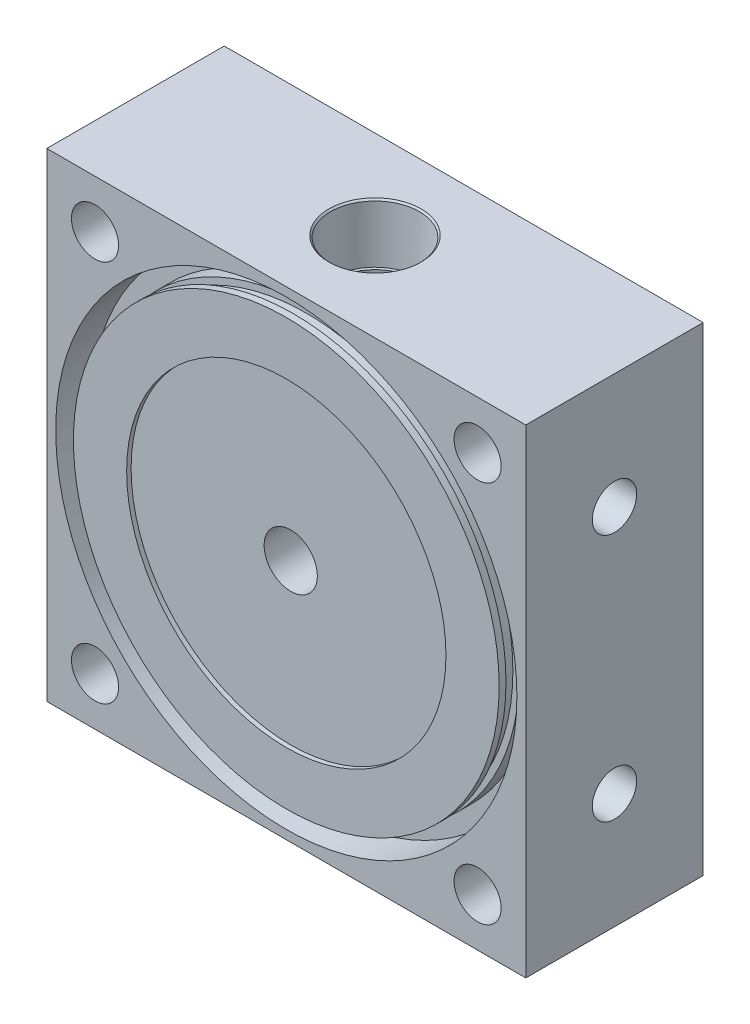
ISO-10303-21;
HEADER;
FILE_DESCRIPTION(('STEP AP214'),'2;1');
FILE_NAME('part.step','',(''),(''),'','','');
FILE_SCHEMA(('AUTOMOTIVE_DESIGN { 1 0 10303 214 1 1 1 1 }'));
ENDSEC;
DATA;
#1=APPLICATION_CONTEXT('core data for automotive mechanical design processes');
#2=APPLICATION_PROTOCOL_DEFINITION('international standard','automotive_design',2000,#1);
#3=PRODUCT_CONTEXT('',#1,'mechanical');
#4=PRODUCT('Part','Part','',(#3));
#5=PRODUCT_RELATED_PRODUCT_CATEGORY('part','',(#4));
#6=PRODUCT_DEFINITION_FORMATION('','',#4);
#7=PRODUCT_DEFINITION_CONTEXT('part definition',#1,'design');
#8=PRODUCT_DEFINITION('design','',#6,#7);
#9=PRODUCT_DEFINITION_SHAPE('','',#8);
#10=(LENGTH_UNIT() NAMED_UNIT(*) SI_UNIT(.MILLI.,.METRE.));
#11=(NAMED_UNIT(*) PLANE_ANGLE_UNIT() SI_UNIT($,.RADIAN.));
#12=(NAMED_UNIT(*) SI_UNIT($,.STERADIAN.) SOLID_ANGLE_UNIT());
#13=UNCERTAINTY_MEASURE_WITH_UNIT(LENGTH_MEASURE(1.E-05),#10,'distance_accuracy_value','');
#14=(GEOMETRIC_REPRESENTATION_CONTEXT(3) GLOBAL_UNCERTAINTY_ASSIGNED_CONTEXT((#13)) GLOBAL_UNIT_ASSIGNED_CONTEXT((#10,
#11,#12)) REPRESENTATION_CONTEXT('',''));
#15=CARTESIAN_POINT('',(0.,0.,0.));
#16=DIRECTION('',(0.,0.,1.));
#17=DIRECTION('',(1.,0.,0.));
#18=AXIS2_PLACEMENT_3D('',#15,#16,#17);
#19=CARTESIAN_POINT('',(-42.8625,-42.8625,31.75));
#20=DIRECTION('',(1.,0.,0.));
#21=DIRECTION('',(0.,0.,-1.));
#22=AXIS2_PLACEMENT_3D('',#19,#20,#21);
#23=PLANE('',#22);
#24=DIRECTION('',(0.,-1.,0.));
#25=VECTOR('',#24,1.);
#26=CARTESIAN_POINT('',(-42.8625,-42.8625,0.));
#27=LINE('',#26,#25);
#28=CARTESIAN_POINT('',(-42.8625,42.8625,0.));
#29=VERTEX_POINT('',#28);
#30=CARTESIAN_POINT('',(-42.8625,-42.8625,0.));
#31=VERTEX_POINT('',#30);
#32=EDGE_CURVE('E201',#29,#31,#27,.T.);
#33=ORIENTED_EDGE('',*,*,#32,.T.);
#34=DIRECTION('',(0.,0.,-1.));
#35=VECTOR('',#34,1.);
#36=CARTESIAN_POINT('',(-42.8625,-42.8625,31.75));
#37=LINE('',#36,#35);
#38=CARTESIAN_POINT('',(-42.8625,-42.8625,31.75));
#39=VERTEX_POINT('',#38);
#40=EDGE_CURVE('E11',#39,#31,#37,.T.);
#41=ORIENTED_EDGE('',*,*,#40,.F.);
#42=DIRECTION('',(0.,-1.,0.));
#43=VECTOR('',#42,1.);
#44=CARTESIAN_POINT('',(-42.8625,-42.8625,31.75));
#45=LINE('',#44,#43);
#46=CARTESIAN_POINT('',(-42.8625,42.8625,31.75));
#47=VERTEX_POINT('',#46);
#48=EDGE_CURVE('E204',#47,#39,#45,.T.);
#49=ORIENTED_EDGE('',*,*,#48,.F.);
#50=DIRECTION('',(0.,0.,-1.));
#51=VECTOR('',#50,1.);
#52=CARTESIAN_POINT('',(-42.8625,42.8625,31.75));
#53=LINE('',#52,#51);
#54=EDGE_CURVE('E210',#47,#29,#53,.T.);
#55=ORIENTED_EDGE('',*,*,#54,.T.);
#56=EDGE_LOOP('',(#33,#41,#49,#55));
#57=FACE_BOUND('',#56,.T.);
#58=ADVANCED_FACE('F34',(#57),#23,.F.);
#59=CARTESIAN_POINT('',(-42.8625,-42.8625,31.75));
#60=DIRECTION('',(0.,1.,0.));
#61=DIRECTION('',(0.,0.,1.));
#62=AXIS2_PLACEMENT_3D('',#59,#60,#61);
#63=PLANE('',#62);
#64=CARTESIAN_POINT('',(0.,-42.8625,15.875));
#65=DIRECTION('',(0.,-1.,0.));
#66=DIRECTION('',(0.,0.,-1.));
#67=AXIS2_PLACEMENT_3D('',#64,#65,#66);
#68=CIRCLE('',#67,3.175);
#69=CARTESIAN_POINT('',(0.,-42.8625,12.7));
#70=VERTEX_POINT('',#69);
#71=EDGE_CURVE('E115',#70,#70,#68,.T.);
#72=ORIENTED_EDGE('',*,*,#71,.F.);
#73=EDGE_LOOP('',(#72));
#74=FACE_BOUND('',#73,.T.);
#75=DIRECTION('',(1.,0.,0.));
#76=VECTOR('',#75,1.);
#77=CARTESIAN_POINT('',(-42.8625,-42.8625,0.));
#78=LINE('',#77,#76);
#79=CARTESIAN_POINT('',(42.8625,-42.8625,0.));
#80=VERTEX_POINT('',#79);
#81=EDGE_CURVE('E213',#31,#80,#78,.T.);
#82=ORIENTED_EDGE('',*,*,#81,.T.);
#83=DIRECTION('',(0.,0.,-1.));
#84=VECTOR('',#83,1.);
#85=CARTESIAN_POINT('',(42.8625,-42.8625,31.75));
#86=LINE('',#85,#84);
#87=CARTESIAN_POINT('',(42.8625,-42.8625,31.75));
#88=VERTEX_POINT('',#87);
#89=EDGE_CURVE('E47',#88,#80,#86,.T.);
#90=ORIENTED_EDGE('',*,*,#89,.F.);
#91=DIRECTION('',(1.,0.,0.));
#92=VECTOR('',#91,1.);
#93=CARTESIAN_POINT('',(-42.8625,-42.8625,31.75));
#94=LINE('',#93,#92);
#95=EDGE_CURVE('E87',#39,#88,#94,.T.);
#96=ORIENTED_EDGE('',*,*,#95,.F.);
#97=ORIENTED_EDGE('',*,*,#40,.T.);
#98=EDGE_LOOP('',(#82,#90,#96,#97));
#99=FACE_BOUND('',#98,.T.);
#100=ADVANCED_FACE('F244',(#74,#99),#63,.F.);
#101=CARTESIAN_POINT('',(42.8625,-42.8625,31.75));
#102=DIRECTION('',(-1.,0.,0.));
#103=DIRECTION('',(0.,-1.,0.));
#104=AXIS2_PLACEMENT_3D('',#101,#102,#103);
#105=PLANE('',#104);
#106=CARTESIAN_POINT('',(42.8625,22.225,15.875));
#107=DIRECTION('',(1.,0.,0.));
#108=DIRECTION('',(0.,0.,-1.));
#109=AXIS2_PLACEMENT_3D('',#106,#107,#108);
#110=CIRCLE('',#109,3.96875);
#111=CARTESIAN_POINT('',(42.8625,22.225,11.90625));
#112=VERTEX_POINT('',#111);
#113=EDGE_CURVE('E105',#112,#112,#110,.T.);
#114=ORIENTED_EDGE('',*,*,#113,.F.);
#115=EDGE_LOOP('',(#114));
#116=FACE_BOUND('',#115,.T.);
#117=CARTESIAN_POINT('',(42.8625,-22.225,15.875));
#118=DIRECTION('',(1.,0.,0.));
#119=DIRECTION('',(0.,0.,-1.));
#120=AXIS2_PLACEMENT_3D('',#117,#118,#119);
#121=CIRCLE('',#120,3.96875);
#122=CARTESIAN_POINT('',(42.8625,-22.225,11.90625));
#123=VERTEX_POINT('',#122);
#124=EDGE_CURVE('E104',#123,#123,#121,.T.);
#125=ORIENTED_EDGE('',*,*,#124,.F.);
#126=EDGE_LOOP('',(#125));
#127=FACE_BOUND('',#126,.T.);
#128=DIRECTION('',(0.,1.,0.));
#129=VECTOR('',#128,1.);
#130=CARTESIAN_POINT('',(42.8625,-42.8625,0.));
#131=LINE('',#130,#129);
#132=CARTESIAN_POINT('',(42.8625,42.8625,0.));
#133=VERTEX_POINT('',#132);
#134=EDGE_CURVE('E74',#80,#133,#131,.T.);
#135=ORIENTED_EDGE('',*,*,#134,.T.);
#136=DIRECTION('',(0.,0.,-1.));
#137=VECTOR('',#136,1.);
#138=CARTESIAN_POINT('',(42.8625,42.8625,31.75));
#139=LINE('',#138,#137);
#140=CARTESIAN_POINT('',(42.8625,42.8625,31.75));
#141=VERTEX_POINT('',#140);
#142=EDGE_CURVE('E218',#141,#133,#139,.T.);
#143=ORIENTED_EDGE('',*,*,#142,.F.);
#144=DIRECTION('',(0.,1.,0.));
#145=VECTOR('',#144,1.);
#146=CARTESIAN_POINT('',(42.8625,-42.8625,31.75));
#147=LINE('',#146,#145);
#148=EDGE_CURVE('E207',#88,#141,#147,.T.);
#149=ORIENTED_EDGE('',*,*,#148,.F.);
#150=ORIENTED_EDGE('',*,*,#89,.T.);
#151=EDGE_LOOP('',(#135,#143,#149,#150));
#152=FACE_BOUND('',#151,.T.);
#153=ADVANCED_FACE('F249',(#116,#127,#152),#105,.F.);
#154=CARTESIAN_POINT('',(-42.8625,42.8625,31.75));
#155=DIRECTION('',(0.,-1.,0.));
#156=DIRECTION('',(0.,0.,-1.));
#157=AXIS2_PLACEMENT_3D('',#154,#155,#156);
#158=PLANE('',#157);
#159=CARTESIAN_POINT('',(0.,42.8625,15.875));
#160=DIRECTION('',(0.,1.,0.));
#161=DIRECTION('',(0.,0.,1.));
#162=AXIS2_PLACEMENT_3D('',#159,#160,#161);
#163=CIRCLE('',#162,8.255);
#164=CARTESIAN_POINT('',(0.,42.8625,24.13));
#165=VERTEX_POINT('',#164);
#166=EDGE_CURVE('E152',#165,#165,#163,.T.);
#167=ORIENTED_EDGE('',*,*,#166,.F.);
#168=EDGE_LOOP('',(#167));
#169=FACE_BOUND('',#168,.T.);
#170=DIRECTION('',(-1.,0.,0.));
#171=VECTOR('',#170,1.);
#172=CARTESIAN_POINT('',(-42.8625,42.8625,0.));
#173=LINE('',#172,#171);
#174=EDGE_CURVE('E80',#133,#29,#173,.T.);
#175=ORIENTED_EDGE('',*,*,#174,.T.);
#176=ORIENTED_EDGE('',*,*,#54,.F.);
#177=DIRECTION('',(-1.,0.,0.));
#178=VECTOR('',#177,1.);
#179=CARTESIAN_POINT('',(-42.8625,42.8625,31.75));
#180=LINE('',#179,#178);
#181=EDGE_CURVE('E56',#141,#47,#180,.T.);
#182=ORIENTED_EDGE('',*,*,#181,.F.);
#183=ORIENTED_EDGE('',*,*,#142,.T.);
#184=EDGE_LOOP('',(#175,#176,#182,#183));
#185=FACE_BOUND('',#184,.T.);
#186=ADVANCED_FACE('F259',(#169,#185),#158,.F.);
#187=CARTESIAN_POINT('',(-42.8625,42.8625,31.75));
#188=DIRECTION('',(0.,0.,-1.));
#189=DIRECTION('',(-1.,0.,0.));
#190=AXIS2_PLACEMENT_3D('',#187,#188,#189);
#191=PLANE('',#190);
#192=CARTESIAN_POINT('',(-34.2372264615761,34.2372264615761,31.75));
#193=DIRECTION('',(0.,0.,1.));
#194=DIRECTION('',(1.,0.,0.));
#195=AXIS2_PLACEMENT_3D('',#192,#193,#194);
#196=CIRCLE('',#195,4.21639999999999);
#197=CARTESIAN_POINT('',(-30.0208264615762,34.2372264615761,31.75));
#198=VERTEX_POINT('',#197);
#199=EDGE_CURVE('E167',#198,#198,#196,.T.);
#200=ORIENTED_EDGE('',*,*,#199,.F.);
#201=EDGE_LOOP('',(#200));
#202=FACE_BOUND('',#201,.T.);
#203=CARTESIAN_POINT('',(34.2372264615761,34.2372264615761,31.75));
#204=DIRECTION('',(0.,0.,1.));
#205=DIRECTION('',(1.,0.,0.));
#206=AXIS2_PLACEMENT_3D('',#203,#204,#205);
#207=CIRCLE('',#206,4.21639999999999);
#208=CARTESIAN_POINT('',(38.4536264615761,34.2372264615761,31.75));
#209=VERTEX_POINT('',#208);
#210=EDGE_CURVE('E173',#209,#209,#207,.T.);
#211=ORIENTED_EDGE('',*,*,#210,.F.);
#212=EDGE_LOOP('',(#211));
#213=FACE_BOUND('',#212,.T.);
#214=CARTESIAN_POINT('',(34.2372264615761,-34.2372264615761,31.75));
#215=DIRECTION('',(0.,0.,1.));
#216=DIRECTION('',(1.,0.,0.));
#217=AXIS2_PLACEMENT_3D('',#214,#215,#216);
#218=CIRCLE('',#217,4.21639999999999);
#219=CARTESIAN_POINT('',(38.4536264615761,-34.2372264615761,31.75));
#220=VERTEX_POINT('',#219);
#221=EDGE_CURVE('E179',#220,#220,#218,.T.);
#222=ORIENTED_EDGE('',*,*,#221,.F.);
#223=EDGE_LOOP('',(#222));
#224=FACE_BOUND('',#223,.T.);
#225=CARTESIAN_POINT('',(-34.2372264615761,-34.2372264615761,31.75));
#226=DIRECTION('',(0.,0.,1.));
#227=DIRECTION('',(1.,0.,0.));
#228=AXIS2_PLACEMENT_3D('',#225,#226,#227);
#229=CIRCLE('',#228,4.21639999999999);
#230=CARTESIAN_POINT('',(-30.0208264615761,-34.2372264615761,31.75));
#231=VERTEX_POINT('',#230);
#232=EDGE_CURVE('E185',#231,#231,#229,.T.);
#233=ORIENTED_EDGE('',*,*,#232,.F.);
#234=EDGE_LOOP('',(#233));
#235=FACE_BOUND('',#234,.T.);
#236=CARTESIAN_POINT('',(0.,0.,31.75));
#237=DIRECTION('',(0.,0.,1.));
#238=DIRECTION('',(1.,0.,0.));
#239=AXIS2_PLACEMENT_3D('',#236,#237,#238);
#240=CIRCLE('',#239,41.275);
#241=CARTESIAN_POINT('',(41.275,0.,31.75));
#242=VERTEX_POINT('',#241);
#243=EDGE_CURVE('E195',#242,#242,#240,.T.);
#244=ORIENTED_EDGE('',*,*,#243,.F.);
#245=EDGE_LOOP('',(#244));
#246=FACE_BOUND('',#245,.T.);
#247=ORIENTED_EDGE('',*,*,#48,.T.);
#248=ORIENTED_EDGE('',*,*,#95,.T.);
#249=ORIENTED_EDGE('',*,*,#148,.T.);
#250=ORIENTED_EDGE('',*,*,#181,.T.);
#251=EDGE_LOOP('',(#247,#248,#249,#250));
#252=FACE_BOUND('',#251,.T.);
#253=ADVANCED_FACE('F257',(#202,#213,#224,#235,#246,#252),#191,.F.);
#254=CARTESIAN_POINT('',(-42.8625,42.8625,0.));
#255=DIRECTION('',(0.,0.,-1.));
#256=DIRECTION('',(-1.,0.,0.));
#257=AXIS2_PLACEMENT_3D('',#254,#255,#256);
#258=PLANE('',#257);
#259=CARTESIAN_POINT('',(-34.2372264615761,34.2372264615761,0.));
#260=DIRECTION('',(0.,0.,1.));
#261=DIRECTION('',(1.,0.,0.));
#262=AXIS2_PLACEMENT_3D('',#259,#260,#261);
#263=CIRCLE('',#262,4.21639999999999);
#264=CARTESIAN_POINT('',(-30.0208264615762,34.2372264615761,0.));
#265=VERTEX_POINT('',#264);
#266=EDGE_CURVE('E170',#265,#265,#263,.T.);
#267=ORIENTED_EDGE('',*,*,#266,.T.);
#268=EDGE_LOOP('',(#267));
#269=FACE_BOUND('',#268,.T.);
#270=CARTESIAN_POINT('',(34.2372264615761,34.2372264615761,0.));
#271=DIRECTION('',(0.,0.,1.));
#272=DIRECTION('',(1.,0.,0.));
#273=AXIS2_PLACEMENT_3D('',#270,#271,#272);
#274=CIRCLE('',#273,4.21639999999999);
#275=CARTESIAN_POINT('',(38.4536264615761,34.2372264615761,0.));
#276=VERTEX_POINT('',#275);
#277=EDGE_CURVE('E176',#276,#276,#274,.T.);
#278=ORIENTED_EDGE('',*,*,#277,.T.);
#279=EDGE_LOOP('',(#278));
#280=FACE_BOUND('',#279,.T.);
#281=CARTESIAN_POINT('',(34.2372264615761,-34.2372264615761,0.));
#282=DIRECTION('',(0.,0.,1.));
#283=DIRECTION('',(1.,0.,0.));
#284=AXIS2_PLACEMENT_3D('',#281,#282,#283);
#285=CIRCLE('',#284,4.21639999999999);
#286=CARTESIAN_POINT('',(38.4536264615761,-34.2372264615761,0.));
#287=VERTEX_POINT('',#286);
#288=EDGE_CURVE('E182',#287,#287,#285,.T.);
#289=ORIENTED_EDGE('',*,*,#288,.T.);
#290=EDGE_LOOP('',(#289));
#291=FACE_BOUND('',#290,.T.);
#292=CARTESIAN_POINT('',(-34.2372264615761,-34.2372264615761,0.));
#293=DIRECTION('',(0.,0.,1.));
#294=DIRECTION('',(1.,0.,0.));
#295=AXIS2_PLACEMENT_3D('',#292,#293,#294);
#296=CIRCLE('',#295,4.21639999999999);
#297=CARTESIAN_POINT('',(-30.0208264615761,-34.2372264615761,0.));
#298=VERTEX_POINT('',#297);
#299=EDGE_CURVE('E188',#298,#298,#296,.T.);
#300=ORIENTED_EDGE('',*,*,#299,.T.);
#301=EDGE_LOOP('',(#300));
#302=FACE_BOUND('',#301,.T.);
#303=ORIENTED_EDGE('',*,*,#32,.F.);
#304=ORIENTED_EDGE('',*,*,#174,.F.);
#305=ORIENTED_EDGE('',*,*,#134,.F.);
#306=ORIENTED_EDGE('',*,*,#81,.F.);
#307=EDGE_LOOP('',(#303,#304,#305,#306));
#308=FACE_BOUND('',#307,.T.);
#309=ADVANCED_FACE('F255',(#269,#280,#291,#302,#308),#258,.T.);
#310=CARTESIAN_POINT('',(0.,0.,25.4));
#311=DIRECTION('',(0.,0.,1.));
#312=DIRECTION('',(1.,0.,0.));
#313=AXIS2_PLACEMENT_3D('',#310,#311,#312);
#314=CYLINDRICAL_SURFACE('',#313,41.275);
#315=CARTESIAN_POINT('',(0.,0.,25.4));
#316=DIRECTION('',(0.,0.,1.));
#317=DIRECTION('',(1.,0.,0.));
#318=AXIS2_PLACEMENT_3D('',#315,#316,#317);
#319=CIRCLE('',#318,41.275);
#320=CARTESIAN_POINT('',(41.275,0.,25.4));
#321=VERTEX_POINT('',#320);
#322=EDGE_CURVE('E198',#321,#321,#319,.T.);
#323=ORIENTED_EDGE('',*,*,#322,.F.);
#324=EDGE_LOOP('',(#323));
#325=FACE_BOUND('',#324,.T.);
#326=ORIENTED_EDGE('',*,*,#243,.T.);
#327=EDGE_LOOP('',(#326));
#328=FACE_BOUND('',#327,.T.);
#329=ADVANCED_FACE('F267',(#325,#328),#314,.F.);
#330=CARTESIAN_POINT('',(0.,0.,25.4));
#331=DIRECTION('',(0.,0.,1.));
#332=DIRECTION('',(1.,0.,0.));
#333=AXIS2_PLACEMENT_3D('',#330,#331,#332);
#334=PLANE('',#333);
#335=CARTESIAN_POINT('',(0.,0.,25.4));
#336=DIRECTION('',(0.,0.,1.));
#337=DIRECTION('',(1.,0.,0.));
#338=AXIS2_PLACEMENT_3D('',#335,#336,#337);
#339=CIRCLE('',#338,38.1);
#340=CARTESIAN_POINT('',(38.1,0.,25.4));
#341=VERTEX_POINT('',#340);
#342=EDGE_CURVE('E192',#341,#341,#339,.T.);
#343=ORIENTED_EDGE('',*,*,#342,.F.);
#344=EDGE_LOOP('',(#343));
#345=FACE_BOUND('',#344,.T.);
#346=ORIENTED_EDGE('',*,*,#322,.T.);
#347=EDGE_LOOP('',(#346));
#348=FACE_BOUND('',#347,.T.);
#349=ADVANCED_FACE('F429',(#345,#348),#334,.T.);
#350=CARTESIAN_POINT('',(0.,0.,25.4));
#351=DIRECTION('',(0.,0.,1.));
#352=DIRECTION('',(1.,0.,0.));
#353=AXIS2_PLACEMENT_3D('',#350,#351,#352);
#354=CYLINDRICAL_SURFACE('',#353,38.1);
#355=CARTESIAN_POINT('',(0.,0.,28.14955));
#356=DIRECTION('',(0.,0.,-1.));
#357=DIRECTION('',(-1.,0.,0.));
#358=AXIS2_PLACEMENT_3D('',#355,#356,#357);
#359=CIRCLE('',#358,38.1);
#360=CARTESIAN_POINT('',(-38.1,0.,28.14955));
#361=VERTEX_POINT('',#360);
#362=EDGE_CURVE('E133',#361,#361,#359,.T.);
#363=ORIENTED_EDGE('',*,*,#362,.T.);
#364=EDGE_LOOP('',(#363));
#365=FACE_BOUND('',#364,.T.);
#366=ORIENTED_EDGE('',*,*,#342,.T.);
#367=EDGE_LOOP('',(#366));
#368=FACE_BOUND('',#367,.T.);
#369=ADVANCED_FACE('F285',(#365,#368),#354,.T.);
#370=CARTESIAN_POINT('',(-34.2372264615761,-34.2372264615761,31.75));
#371=DIRECTION('',(0.,0.,1.));
#372=DIRECTION('',(1.,0.,0.));
#373=AXIS2_PLACEMENT_3D('',#370,#371,#372);
#374=CYLINDRICAL_SURFACE('',#373,4.21639999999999);
#375=ORIENTED_EDGE('',*,*,#299,.F.);
#376=EDGE_LOOP('',(#375));
#377=FACE_BOUND('',#376,.T.);
#378=ORIENTED_EDGE('',*,*,#232,.T.);
#379=EDGE_LOOP('',(#378));
#380=FACE_BOUND('',#379,.T.);
#381=ADVANCED_FACE('F428',(#377,#380),#374,.F.);
#382=CARTESIAN_POINT('',(34.2372264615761,-34.2372264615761,31.75));
#383=DIRECTION('',(0.,0.,1.));
#384=DIRECTION('',(1.,0.,0.));
#385=AXIS2_PLACEMENT_3D('',#382,#383,#384);
#386=CYLINDRICAL_SURFACE('',#385,4.21639999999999);
#387=ORIENTED_EDGE('',*,*,#288,.F.);
#388=EDGE_LOOP('',(#387));
#389=FACE_BOUND('',#388,.T.);
#390=ORIENTED_EDGE('',*,*,#221,.T.);
#391=EDGE_LOOP('',(#390));
#392=FACE_BOUND('',#391,.T.);
#393=ADVANCED_FACE('F537',(#389,#392),#386,.F.);
#394=CARTESIAN_POINT('',(34.2372264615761,34.2372264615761,31.75));
#395=DIRECTION('',(0.,0.,1.));
#396=DIRECTION('',(1.,0.,0.));
#397=AXIS2_PLACEMENT_3D('',#394,#395,#396);
#398=CYLINDRICAL_SURFACE('',#397,4.21639999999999);
#399=ORIENTED_EDGE('',*,*,#277,.F.);
#400=EDGE_LOOP('',(#399));
#401=FACE_BOUND('',#400,.T.);
#402=ORIENTED_EDGE('',*,*,#210,.T.);
#403=EDGE_LOOP('',(#402));
#404=FACE_BOUND('',#403,.T.);
#405=ADVANCED_FACE('F532',(#401,#404),#398,.F.);
#406=CARTESIAN_POINT('',(-34.2372264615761,34.2372264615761,31.75));
#407=DIRECTION('',(0.,0.,1.));
#408=DIRECTION('',(1.,0.,0.));
#409=AXIS2_PLACEMENT_3D('',#406,#407,#408);
#410=CYLINDRICAL_SURFACE('',#409,4.21639999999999);
#411=ORIENTED_EDGE('',*,*,#266,.F.);
#412=EDGE_LOOP('',(#411));
#413=FACE_BOUND('',#412,.T.);
#414=ORIENTED_EDGE('',*,*,#199,.T.);
#415=EDGE_LOOP('',(#414));
#416=FACE_BOUND('',#415,.T.);
#417=ADVANCED_FACE('F358',(#413,#416),#410,.F.);
#418=CARTESIAN_POINT('',(0.,25.4635,15.875));
#419=DIRECTION('',(0.,1.,0.));
#420=DIRECTION('',(0.,0.,1.));
#421=AXIS2_PLACEMENT_3D('',#418,#419,#420);
#422=CONICAL_SURFACE('',#421,7.1374,1.02974425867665);
#423=CARTESIAN_POINT('',(0.,24.2749521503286,15.875));
#424=DIRECTION('',(0.,1.,0.));
#425=DIRECTION('',(0.,0.,1.));
#426=AXIS2_PLACEMENT_3D('',#423,#424,#425);
#427=CIRCLE('',#426,5.1593242);
#428=CARTESIAN_POINT('',(0.,24.2749521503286,21.0343242));
#429=VERTEX_POINT('',#428);
#430=EDGE_CURVE('E130',#429,#429,#427,.F.);
#431=ORIENTED_EDGE('',*,*,#430,.T.);
#432=EDGE_LOOP('',(#431));
#433=FACE_BOUND('',#432,.T.);
#434=CARTESIAN_POINT('',(0.,25.4635,15.875));
#435=DIRECTION('',(0.,1.,0.));
#436=DIRECTION('',(0.,0.,1.));
#437=AXIS2_PLACEMENT_3D('',#434,#435,#436);
#438=CIRCLE('',#437,7.1374);
#439=CARTESIAN_POINT('',(0.,25.4635,23.0124));
#440=VERTEX_POINT('',#439);
#441=EDGE_CURVE('E164',#440,#440,#438,.T.);
#442=ORIENTED_EDGE('',*,*,#441,.T.);
#443=EDGE_LOOP('',(#442));
#444=FACE_BOUND('',#443,.T.);
#445=ADVANCED_FACE('F369',(#433,#444),#422,.F.);
#446=CARTESIAN_POINT('',(0.,42.8625,15.875));
#447=DIRECTION('',(0.,1.,0.));
#448=DIRECTION('',(0.,0.,1.));
#449=AXIS2_PLACEMENT_3D('',#446,#447,#448);
#450=CYLINDRICAL_SURFACE('',#449,7.1374);
#451=ORIENTED_EDGE('',*,*,#441,.F.);
#452=EDGE_LOOP('',(#451));
#453=FACE_BOUND('',#452,.T.);
#454=CARTESIAN_POINT('',(0.,32.5247,15.875));
#455=DIRECTION('',(0.,1.,0.));
#456=DIRECTION('',(0.,0.,1.));
#457=AXIS2_PLACEMENT_3D('',#454,#455,#456);
#458=CIRCLE('',#457,7.1374);
#459=CARTESIAN_POINT('',(0.,32.5247,23.0124));
#460=VERTEX_POINT('',#459);
#461=EDGE_CURVE('E161',#460,#460,#458,.T.);
#462=ORIENTED_EDGE('',*,*,#461,.T.);
#463=EDGE_LOOP('',(#462));
#464=FACE_BOUND('',#463,.T.);
#465=ADVANCED_FACE('F363',(#453,#464),#450,.F.);
#466=CARTESIAN_POINT('',(7.1374,32.5247,15.875));
#467=DIRECTION('',(0.,-1.,0.));
#468=DIRECTION('',(0.,0.,-1.));
#469=AXIS2_PLACEMENT_3D('',#466,#467,#468);
#470=PLANE('',#469);
#471=ORIENTED_EDGE('',*,*,#461,.F.);
#472=EDGE_LOOP('',(#471));
#473=FACE_BOUND('',#472,.T.);
#474=CARTESIAN_POINT('',(0.,32.5247,15.875));
#475=DIRECTION('',(0.,1.,0.));
#476=DIRECTION('',(0.,0.,1.));
#477=AXIS2_PLACEMENT_3D('',#474,#475,#476);
#478=CIRCLE('',#477,7.66468079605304);
#479=CARTESIAN_POINT('',(0.,32.5247,23.539680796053));
#480=VERTEX_POINT('',#479);
#481=EDGE_CURVE('E158',#480,#480,#478,.T.);
#482=ORIENTED_EDGE('',*,*,#481,.T.);
#483=EDGE_LOOP('',(#482));
#484=FACE_BOUND('',#483,.T.);
#485=ADVANCED_FACE('F368',(#473,#484),#470,.F.);
#486=CARTESIAN_POINT('',(0.,42.5730416,15.875));
#487=DIRECTION('',(0.,1.,0.));
#488=DIRECTION('',(0.,0.,1.));
#489=AXIS2_PLACEMENT_3D('',#486,#487,#488);
#490=CONICAL_SURFACE('',#489,7.9655416,0.029932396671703);
#491=ORIENTED_EDGE('',*,*,#481,.F.);
#492=EDGE_LOOP('',(#491));
#493=FACE_BOUND('',#492,.T.);
#494=CARTESIAN_POINT('',(0.,42.5730416,15.875));
#495=DIRECTION('',(0.,1.,0.));
#496=DIRECTION('',(0.,0.,1.));
#497=AXIS2_PLACEMENT_3D('',#494,#495,#496);
#498=CIRCLE('',#497,7.9655416);
#499=CARTESIAN_POINT('',(0.,42.5730416,23.8405416));
#500=VERTEX_POINT('',#499);
#501=EDGE_CURVE('E155',#500,#500,#498,.T.);
#502=ORIENTED_EDGE('',*,*,#501,.T.);
#503=EDGE_LOOP('',(#502));
#504=FACE_BOUND('',#503,.T.);
#505=ADVANCED_FACE('F381',(#493,#504),#490,.F.);
#506=CARTESIAN_POINT('',(0.,42.8625,15.875));
#507=DIRECTION('',(0.,1.,0.));
#508=DIRECTION('',(0.,0.,1.));
#509=AXIS2_PLACEMENT_3D('',#506,#507,#508);
#510=CONICAL_SURFACE('',#509,8.255,0.785398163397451);
#511=ORIENTED_EDGE('',*,*,#501,.F.);
#512=EDGE_LOOP('',(#511));
#513=FACE_BOUND('',#512,.T.);
#514=ORIENTED_EDGE('',*,*,#166,.T.);
#515=EDGE_LOOP('',(#514));
#516=FACE_BOUND('',#515,.T.);
#517=ADVANCED_FACE('F299',(#513,#516),#510,.F.);
#518=CARTESIAN_POINT('',(0.,38.1,30.5308));
#519=DIRECTION('',(0.,0.,1.));
#520=DIRECTION('',(1.,0.,0.));
#521=AXIS2_PLACEMENT_3D('',#518,#519,#520);
#522=PLANE('',#521);
#523=CARTESIAN_POINT('',(0.,0.,30.5308));
#524=DIRECTION('',(0.,0.,-1.));
#525=DIRECTION('',(-1.,0.,0.));
#526=AXIS2_PLACEMENT_3D('',#523,#524,#525);
#527=CIRCLE('',#526,36.957);
#528=CARTESIAN_POINT('',(-36.957,0.,30.5308));
#529=VERTEX_POINT('',#528);
#530=EDGE_CURVE('E139',#529,#529,#527,.T.);
#531=ORIENTED_EDGE('',*,*,#530,.F.);
#532=EDGE_LOOP('',(#531));
#533=FACE_BOUND('',#532,.T.);
#534=CARTESIAN_POINT('',(0.,0.,30.5308));
#535=DIRECTION('',(0.,0.,-1.));
#536=DIRECTION('',(-1.,0.,0.));
#537=AXIS2_PLACEMENT_3D('',#534,#535,#536);
#538=CIRCLE('',#537,38.1);
#539=CARTESIAN_POINT('',(-38.1,0.,30.5308));
#540=VERTEX_POINT('',#539);
#541=EDGE_CURVE('E142',#540,#540,#538,.T.);
#542=ORIENTED_EDGE('',*,*,#541,.T.);
#543=EDGE_LOOP('',(#542));
#544=FACE_BOUND('',#543,.T.);
#545=ADVANCED_FACE('F296',(#533,#544),#522,.F.);
#546=CARTESIAN_POINT('',(0.,0.,0.));
#547=DIRECTION('',(0.,0.,-1.));
#548=DIRECTION('',(-1.,0.,0.));
#549=AXIS2_PLACEMENT_3D('',#546,#547,#548);
#550=CYLINDRICAL_SURFACE('',#549,36.957);
#551=CARTESIAN_POINT('',(0.,0.,28.14955));
#552=DIRECTION('',(0.,0.,-1.));
#553=DIRECTION('',(-1.,0.,0.));
#554=AXIS2_PLACEMENT_3D('',#551,#552,#553);
#555=CIRCLE('',#554,36.957);
#556=CARTESIAN_POINT('',(-36.957,0.,28.14955));
#557=VERTEX_POINT('',#556);
#558=EDGE_CURVE('E136',#557,#557,#555,.T.);
#559=ORIENTED_EDGE('',*,*,#558,.F.);
#560=EDGE_LOOP('',(#559));
#561=FACE_BOUND('',#560,.T.);
#562=ORIENTED_EDGE('',*,*,#530,.T.);
#563=EDGE_LOOP('',(#562));
#564=FACE_BOUND('',#563,.T.);
#565=ADVANCED_FACE('F236',(#561,#564),#550,.T.);
#566=CARTESIAN_POINT('',(0.,36.957,28.14955));
#567=DIRECTION('',(0.,0.,-1.));
#568=DIRECTION('',(-1.,0.,0.));
#569=AXIS2_PLACEMENT_3D('',#566,#567,#568);
#570=PLANE('',#569);
#571=ORIENTED_EDGE('',*,*,#362,.F.);
#572=EDGE_LOOP('',(#571));
#573=FACE_BOUND('',#572,.T.);
#574=ORIENTED_EDGE('',*,*,#558,.T.);
#575=EDGE_LOOP('',(#574));
#576=FACE_BOUND('',#575,.T.);
#577=ADVANCED_FACE('F227',(#573,#576),#570,.F.);
#578=CARTESIAN_POINT('',(0.,0.,31.75));
#579=DIRECTION('',(0.,0.,1.));
#580=DIRECTION('',(1.,0.,0.));
#581=AXIS2_PLACEMENT_3D('',#578,#579,#580);
#582=CYLINDRICAL_SURFACE('',#581,4.7625);
#583=CARTESIAN_POINT('',(4.7625,0.,17.8592429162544));
#584=CARTESIAN_POINT('',(4.76249932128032,-0.0659606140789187,17.8592455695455));
#585=CARTESIAN_POINT('',(4.76112335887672,-0.131941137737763,17.8625573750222));
#586=CARTESIAN_POINT('',(4.75567793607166,-0.263176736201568,17.8755496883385));
#587=CARTESIAN_POINT('',(4.75160634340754,-0.328431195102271,17.8852352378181));
#588=CARTESIAN_POINT('',(4.73551560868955,-0.522659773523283,17.9229932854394));
#589=CARTESIAN_POINT('',(4.71962195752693,-0.649661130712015,17.9597603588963));
#590=CARTESIAN_POINT('',(4.68395863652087,-0.866629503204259,18.0384540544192));
#591=CARTESIAN_POINT('',(4.66601410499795,-0.958211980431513,18.0770653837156));
#592=CARTESIAN_POINT('',(4.62559489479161,-1.13740897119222,18.1607522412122));
#593=CARTESIAN_POINT('',(4.60311669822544,-1.22502033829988,18.2058327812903));
#594=CARTESIAN_POINT('',(4.55393145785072,-1.39682904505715,18.3005286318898));
#595=CARTESIAN_POINT('',(4.52721220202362,-1.48101561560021,18.3501568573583));
#596=CARTESIAN_POINT('',(4.46980220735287,-1.64618068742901,18.45239067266));
#597=CARTESIAN_POINT('',(4.4391101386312,-1.7271581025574,18.5049972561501));
#598=CARTESIAN_POINT('',(4.345897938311,-1.95451844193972,18.6580412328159));
#599=CARTESIAN_POINT('',(4.27865895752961,-2.09742346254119,18.7608000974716));
#600=CARTESIAN_POINT('',(4.13111497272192,-2.37486089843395,18.9683476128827));
#601=CARTESIAN_POINT('',(4.05080050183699,-2.50938714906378,19.0731376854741));
#602=CARTESIAN_POINT('',(3.87706373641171,-2.7702523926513,19.2816691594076));
#603=CARTESIAN_POINT('',(3.78365800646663,-2.89660144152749,19.3854117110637));
#604=CARTESIAN_POINT('',(3.58343763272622,-3.1409085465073,19.589573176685));
#605=CARTESIAN_POINT('',(3.47663042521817,-3.25887119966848,19.6899938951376));
#606=CARTESIAN_POINT('',(3.19363491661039,-3.54108022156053,19.9332141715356));
#607=CARTESIAN_POINT('',(3.00901509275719,-3.69983881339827,20.0727944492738));
#608=CARTESIAN_POINT('',(2.60885987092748,-3.99204693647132,20.3324921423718));
#609=CARTESIAN_POINT('',(2.39337931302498,-4.12554040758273,20.452643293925));
#610=CARTESIAN_POINT('',(1.97968590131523,-4.33641843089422,20.643667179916));
#611=CARTESIAN_POINT('',(1.78687825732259,-4.41969277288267,20.7195923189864));
#612=CARTESIAN_POINT('',(1.48585992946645,-4.52603515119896,20.8168633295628));
#613=CARTESIAN_POINT('',(1.3835221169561,-4.55839426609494,20.8465235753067));
#614=CARTESIAN_POINT('',(1.17544913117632,-4.61642405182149,20.8997842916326));
#615=CARTESIAN_POINT('',(1.06971547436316,-4.6420976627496,20.9233874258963));
#616=CARTESIAN_POINT('',(0.85473900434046,-4.68646603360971,20.9642148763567));
#617=CARTESIAN_POINT('',(0.745476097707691,-4.7051080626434,20.9813909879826));
#618=CARTESIAN_POINT('',(0.525097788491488,-4.7347683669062,21.0087333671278));
#619=CARTESIAN_POINT('',(0.413983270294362,-4.74579018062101,21.0189028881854));
#620=CARTESIAN_POINT('',(0.190841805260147,-4.75998762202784,21.0320044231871));
#621=CARTESIAN_POINT('',(0.0788149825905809,-4.76316430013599,21.0349374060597));
#622=CARTESIAN_POINT('',(-0.145129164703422,-4.76160485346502,21.0334979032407));
#623=CARTESIAN_POINT('',(-0.257046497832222,-4.75686940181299,21.0291260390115));
#624=CARTESIAN_POINT('',(-0.467545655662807,-4.74053766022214,21.01405716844));
#625=CARTESIAN_POINT('',(-0.566245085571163,-4.72974991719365,21.0041056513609));
#626=CARTESIAN_POINT('',(-0.762092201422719,-4.70217168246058,20.9786859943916));
#627=CARTESIAN_POINT('',(-0.859239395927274,-4.68537932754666,20.9632161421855));
#628=CARTESIAN_POINT('',(-1.14735357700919,-4.62637181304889,20.9089142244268));
#629=CARTESIAN_POINT('',(-1.33516512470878,-4.57551226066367,20.8621768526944));
#630=CARTESIAN_POINT('',(-1.70562971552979,-4.45107407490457,20.7482561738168));
#631=CARTESIAN_POINT('',(-1.88775557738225,-4.37664947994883,20.6803131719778));
#632=CARTESIAN_POINT('',(-2.23607304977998,-4.20936603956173,20.5284680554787));
#633=CARTESIAN_POINT('',(-2.40225741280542,-4.11649886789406,20.4445587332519));
#634=CARTESIAN_POINT('',(-2.80062856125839,-3.86255250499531,20.2168678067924));
#635=CARTESIAN_POINT('',(-3.02165446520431,-3.69126056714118,20.0647827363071));
#636=CARTESIAN_POINT('',(-3.32343068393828,-3.41394336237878,19.8234404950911));
#637=CARTESIAN_POINT('',(-3.41921777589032,-3.3179031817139,19.7406184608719));
#638=CARTESIAN_POINT('',(-3.6010715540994,-3.11957790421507,19.5717913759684));
#639=CARTESIAN_POINT('',(-3.68713995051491,-3.01729391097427,19.4857868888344));
#640=CARTESIAN_POINT('',(-3.8517434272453,-2.8042929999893,19.3097614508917));
#641=CARTESIAN_POINT('',(-3.93003742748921,-2.69342948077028,19.2196938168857));
#642=CARTESIAN_POINT('',(-4.07681732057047,-2.46563070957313,19.039129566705));
#643=CARTESIAN_POINT('',(-4.14529948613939,-2.34869317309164,18.9486328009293));
#644=CARTESIAN_POINT('',(-4.27234694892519,-2.10875604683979,18.7694266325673));
#645=CARTESIAN_POINT('',(-4.33093583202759,-1.98577180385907,18.6807134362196));
#646=CARTESIAN_POINT('',(-4.43824273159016,-1.73271341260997,18.5076697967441));
#647=CARTESIAN_POINT('',(-4.48696942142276,-1.60264562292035,18.423335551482));
#648=CARTESIAN_POINT('',(-4.56795313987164,-1.35275583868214,18.2746988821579));
#649=CARTESIAN_POINT('',(-4.60156292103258,-1.23406799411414,18.2092476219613));
#650=CARTESIAN_POINT('',(-4.66035855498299,-0.989090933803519,18.089523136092));
#651=CARTESIAN_POINT('',(-4.68555282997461,-0.862809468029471,18.0352387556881));
#652=CARTESIAN_POINT('',(-4.72251754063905,-0.625276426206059,17.9530133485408));
#653=CARTESIAN_POINT('',(-4.73587762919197,-0.51534035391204,17.9221055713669));
#654=CARTESIAN_POINT('',(-4.75488952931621,-0.291483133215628,17.8775664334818));
#655=CARTESIAN_POINT('',(-4.76056302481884,-0.177574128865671,17.8638864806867));
#656=CARTESIAN_POINT('',(-4.76360456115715,0.0516496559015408,17.8565967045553));
#657=CARTESIAN_POINT('',(-4.7609284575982,0.1669686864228,17.8630935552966));
#658=CARTESIAN_POINT('',(-4.74750438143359,0.394574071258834,17.8949246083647));
#659=CARTESIAN_POINT('',(-4.73673746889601,0.506852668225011,17.9203030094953));
#660=CARTESIAN_POINT('',(-4.70128707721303,0.778509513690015,18.000839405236));
#661=CARTESIAN_POINT('',(-4.67241051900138,0.934730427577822,18.0644350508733));
#662=CARTESIAN_POINT('',(-4.60193121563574,1.23603250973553,18.208958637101));
#663=CARTESIAN_POINT('',(-4.56027182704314,1.38106042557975,18.2899632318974));
#664=CARTESIAN_POINT('',(-4.4647804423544,1.66427392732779,18.4623303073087));
#665=CARTESIAN_POINT('',(-4.41074532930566,1.80229216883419,18.5538512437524));
#666=CARTESIAN_POINT('',(-4.29140687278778,2.0704551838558,18.7411511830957));
#667=CARTESIAN_POINT('',(-4.22609346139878,2.20059278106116,18.8369339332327));
#668=CARTESIAN_POINT('',(-4.08428211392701,2.45379039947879,19.0296143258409));
#669=CARTESIAN_POINT('',(-4.00778209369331,2.57684909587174,19.1265121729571));
#670=CARTESIAN_POINT('',(-3.84348963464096,2.81603114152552,19.3191608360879));
#671=CARTESIAN_POINT('',(-3.75570236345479,2.932157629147,19.414912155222));
#672=CARTESIAN_POINT('',(-3.5793356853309,3.14428300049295,19.5926326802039));
#673=CARTESIAN_POINT('',(-3.49201408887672,3.24105898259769,19.6749182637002));
#674=CARTESIAN_POINT('',(-3.30815885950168,3.42851918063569,19.8360193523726));
#675=CARTESIAN_POINT('',(-3.2116242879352,3.51920277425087,19.9148345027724));
#676=CARTESIAN_POINT('',(-2.90829906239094,3.78078461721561,20.1440092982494));
#677=CARTESIAN_POINT('',(-2.68729714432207,3.941813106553,20.2876081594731));
#678=CARTESIAN_POINT('',(-2.26745717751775,4.19334765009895,20.5138804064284));
#679=CARTESIAN_POINT('',(-2.07660005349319,4.29145141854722,20.6028447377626));
#680=CARTESIAN_POINT('',(-1.7761938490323,4.42023106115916,20.7201367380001));
#681=CARTESIAN_POINT('',(-1.673671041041,4.46010445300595,20.7565504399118));
#682=CARTESIAN_POINT('',(-1.46438078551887,4.53312943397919,20.8233598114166));
#683=CARTESIAN_POINT('',(-1.35761519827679,4.56628393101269,20.8537580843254));
#684=CARTESIAN_POINT('',(-1.13945384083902,4.62557509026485,20.9081923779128));
#685=CARTESIAN_POINT('',(-1.02802478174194,4.65164515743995,20.932167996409));
#686=CARTESIAN_POINT('',(-0.802346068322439,4.69583405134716,20.9728429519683));
#687=CARTESIAN_POINT('',(-0.688097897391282,4.71395696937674,20.9895460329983));
#688=CARTESIAN_POINT('',(-0.457775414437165,4.74186660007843,21.0152810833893));
#689=CARTESIAN_POINT('',(-0.341701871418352,4.75165673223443,21.0243161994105));
#690=CARTESIAN_POINT('',(-0.108810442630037,4.76268316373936,21.0344928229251));
#691=CARTESIAN_POINT('',(0.00800734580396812,4.76392055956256,21.0356353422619));
#692=CARTESIAN_POINT('',(0.225824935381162,4.75822111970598,21.0303746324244));
#693=CARTESIAN_POINT('',(0.326878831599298,4.75234090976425,21.0249467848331));
#694=CARTESIAN_POINT('',(0.527957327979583,4.73422222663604,21.0082317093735));
#695=CARTESIAN_POINT('',(0.627981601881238,4.72198179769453,20.9969426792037));
#696=CARTESIAN_POINT('',(0.826236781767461,4.69135310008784,20.9687194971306));
#697=CARTESIAN_POINT('',(0.924468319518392,4.67296704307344,20.9517873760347));
#698=CARTESIAN_POINT('',(1.11858276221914,4.63034243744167,20.9125809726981));
#699=CARTESIAN_POINT('',(1.21446470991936,4.60610154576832,20.8903045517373));
#700=CARTESIAN_POINT('',(1.49833834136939,4.52494449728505,20.8158371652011));
#701=CARTESIAN_POINT('',(1.682055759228,4.4596738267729,20.7560820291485));
#702=CARTESIAN_POINT('',(2.03486361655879,4.31016855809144,20.6198732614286));
#703=CARTESIAN_POINT('',(2.20394680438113,4.22592463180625,20.5434114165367));
#704=CARTESIAN_POINT('',(2.48471181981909,4.06529764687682,20.3986035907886));
#705=CARTESIAN_POINT('',(2.5999905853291,3.99244346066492,20.3332087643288));
#706=CARTESIAN_POINT('',(2.82153541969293,3.83907496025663,20.196401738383));
#707=CARTESIAN_POINT('',(2.92780044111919,3.75855975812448,20.1249888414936));
#708=CARTESIAN_POINT('',(3.13148915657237,3.59063303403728,19.9772272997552));
#709=CARTESIAN_POINT('',(3.22889387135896,3.50320742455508,19.9008686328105));
#710=CARTESIAN_POINT('',(3.41471594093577,3.3223382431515,19.7445068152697));
#711=CARTESIAN_POINT('',(3.50313443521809,3.22889543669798,19.6645041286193));
#712=CARTESIAN_POINT('',(3.67312124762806,3.0342498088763,19.5000670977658));
#713=CARTESIAN_POINT('',(3.7544823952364,2.93291704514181,19.4155729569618));
#714=CARTESIAN_POINT('',(3.90817627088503,2.72475802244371,19.2451554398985));
#715=CARTESIAN_POINT('',(3.98050851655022,2.61793147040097,19.1592319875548));
#716=CARTESIAN_POINT('',(4.11621854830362,2.398903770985,18.9874480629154));
#717=CARTESIAN_POINT('',(4.17960536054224,2.28670819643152,18.901587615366));
#718=CARTESIAN_POINT('',(4.2975354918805,2.05652884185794,18.7316587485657));
#719=CARTESIAN_POINT('',(4.35208245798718,1.93854747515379,18.647589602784));
#720=CARTESIAN_POINT('',(4.45748491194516,1.68324007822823,18.4751306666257));
#721=CARTESIAN_POINT('',(4.50735434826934,1.54518255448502,18.3872114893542));
#722=CARTESIAN_POINT('',(4.59548928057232,1.25907543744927,18.2220829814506));
#723=CARTESIAN_POINT('',(4.63376247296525,1.11103255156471,18.1448665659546));
#724=CARTESIAN_POINT('',(4.68848354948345,0.844252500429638,18.0290005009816));
#725=CARTESIAN_POINT('',(4.70803161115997,0.728291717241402,17.9855607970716));
#726=CARTESIAN_POINT('',(4.73868824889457,0.490359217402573,17.9158231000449));
#727=CARTESIAN_POINT('',(4.74983150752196,0.368414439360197,17.8894547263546));
#728=CARTESIAN_POINT('',(4.75828868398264,0.204368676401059,17.8693254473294));
#729=CARTESIAN_POINT('',(4.75986479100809,0.163607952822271,17.8655574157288));
#730=CARTESIAN_POINT('',(4.76197066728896,0.0819007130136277,17.8605153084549));
#731=CARTESIAN_POINT('',(4.76250042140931,0.0409541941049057,17.8592412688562));
#732=CARTESIAN_POINT('',(4.7625,0.,17.8592429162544));
#733=B_SPLINE_CURVE_WITH_KNOTS('',3,(#583,#584,#585,#586,#587,#588,#589,#590,#591,#592,#593,
#594,#595,#596,#597,#598,#599,#600,#601,#602,#603,#604,#605,#606,#607,#608,#609,#610,#611,#612,
#613,#614,#615,#616,#617,#618,#619,#620,#621,#622,#623,#624,#625,#626,#627,#628,#629,#630,#631,
#632,#633,#634,#635,#636,#637,#638,#639,#640,#641,#642,#643,#644,#645,#646,#647,#648,#649,#650,
#651,#652,#653,#654,#655,#656,#657,#658,#659,#660,#661,#662,#663,#664,#665,#666,#667,#668,#669,
#670,#671,#672,#673,#674,#675,#676,#677,#678,#679,#680,#681,#682,#683,#684,#685,#686,#687,#688,
#689,#690,#691,#692,#693,#694,#695,#696,#697,#698,#699,#700,#701,#702,#703,#704,#705,#706,#707,
#708,#709,#710,#711,#712,#713,#714,#715,#716,#717,#718,#719,#720,#721,#722,#723,#724,#725,#726,
#727,#728,#729,#730,#731,#732),.UNSPECIFIED.,.T.,.F.,(4,2,2,2,2,2,2,2,2,2,2,2,2,2,2,2,2,2,2,2,2,
2,2,2,2,2,2,2,2,2,2,2,2,2,2,2,2,2,2,2,2,2,2,2,2,2,2,2,2,2,2,2,2,2,2,2,2,2,2,2,2,2,2,2,2,2,2,2,2,
2,2,2,2,2,4),(0.,0.197818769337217,0.395794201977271,0.793035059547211,1.09565047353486,
1.39850161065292,1.7022411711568,2.00608267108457,2.57055064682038,3.13542913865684,
3.69959922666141,4.26345763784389,5.10233255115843,5.93973485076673,6.6067774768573,
6.94048726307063,7.27405004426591,7.61006675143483,7.94592732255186,8.28174292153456,
8.61752995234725,8.91652679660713,9.21561649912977,9.81328315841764,10.4354533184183,
11.0579050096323,12.007187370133,12.483665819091,12.9600602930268,13.4483225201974,
13.9367697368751,14.4240355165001,14.9108708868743,15.329192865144,15.7470949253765,
16.0907541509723,16.4334418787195,16.7779444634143,17.1232560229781,17.6337245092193,
18.1464884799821,18.6683625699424,19.1907049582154,19.7131447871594,20.2353462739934,
20.6973521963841,21.1594052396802,22.0807596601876,22.7748331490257,23.1220853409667,
23.4691869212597,23.8194465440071,24.1695256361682,24.519460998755,24.8693514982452,
25.1730926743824,25.4769273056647,25.7806527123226,26.084499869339,26.6937176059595,
27.3032355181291,27.7563674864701,28.2095520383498,28.6636855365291,29.1177613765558,
29.5823989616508,30.0470613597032,30.5112514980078,30.9752496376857,31.4878776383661,
32.0001646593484,32.3751865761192,32.7486523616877,32.8714740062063,32.9942974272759),.UNSPECIFIED.);
#734=CARTESIAN_POINT('',(4.7625,0.,17.8592429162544));
#735=VERTEX_POINT('',#734);
#736=EDGE_CURVE('E37',#735,#735,#733,.T.);
#737=ORIENTED_EDGE('',*,*,#736,.T.);
#738=EDGE_LOOP('',(#737));
#739=FACE_BOUND('',#738,.T.);
#740=CARTESIAN_POINT('',(0.,0.,30.95625));
#741=DIRECTION('',(0.,0.,1.));
#742=DIRECTION('',(1.,0.,0.));
#743=AXIS2_PLACEMENT_3D('',#740,#741,#742);
#744=CIRCLE('',#743,4.7625);
#745=CARTESIAN_POINT('',(4.7625,0.,30.95625));
#746=VERTEX_POINT('',#745);
#747=EDGE_CURVE('E149',#746,#746,#744,.F.);
#748=ORIENTED_EDGE('',*,*,#747,.F.);
#749=EDGE_LOOP('',(#748));
#750=FACE_BOUND('',#749,.T.);
#751=ADVANCED_FACE('F225',(#739,#750),#582,.F.);
#752=CARTESIAN_POINT('',(0.,0.,30.95625));
#753=DIRECTION('',(0.,0.,1.));
#754=DIRECTION('',(1.,0.,0.));
#755=AXIS2_PLACEMENT_3D('',#752,#753,#754);
#756=PLANE('',#755);
#757=CARTESIAN_POINT('',(0.,0.,30.95625));
#758=DIRECTION('',(0.,0.,1.));
#759=DIRECTION('',(1.,0.,0.));
#760=AXIS2_PLACEMENT_3D('',#757,#758,#759);
#761=CIRCLE('',#760,28.575);
#762=CARTESIAN_POINT('',(28.575,0.,30.95625));
#763=VERTEX_POINT('',#762);
#764=EDGE_CURVE('E146',#763,#763,#761,.T.);
#765=ORIENTED_EDGE('',*,*,#764,.T.);
#766=EDGE_LOOP('',(#765));
#767=FACE_BOUND('',#766,.T.);
#768=ORIENTED_EDGE('',*,*,#747,.T.);
#769=EDGE_LOOP('',(#768));
#770=FACE_BOUND('',#769,.T.);
#771=ADVANCED_FACE('F223',(#767,#770),#756,.T.);
#772=CARTESIAN_POINT('',(0.,0.,30.95625));
#773=DIRECTION('',(0.,0.,1.));
#774=DIRECTION('',(1.,0.,0.));
#775=AXIS2_PLACEMENT_3D('',#772,#773,#774);
#776=CYLINDRICAL_SURFACE('',#775,28.575);
#777=ORIENTED_EDGE('',*,*,#764,.F.);
#778=EDGE_LOOP('',(#777));
#779=FACE_BOUND('',#778,.T.);
#780=CARTESIAN_POINT('',(0.,0.,31.75));
#781=DIRECTION('',(0.,0.,1.));
#782=DIRECTION('',(1.,0.,0.));
#783=AXIS2_PLACEMENT_3D('',#780,#781,#782);
#784=CIRCLE('',#783,28.575);
#785=CARTESIAN_POINT('',(28.575,0.,31.75));
#786=VERTEX_POINT('',#785);
#787=EDGE_CURVE('E145',#786,#786,#784,.T.);
#788=ORIENTED_EDGE('',*,*,#787,.T.);
#789=EDGE_LOOP('',(#788));
#790=FACE_BOUND('',#789,.T.);
#791=ADVANCED_FACE('F233',(#779,#790),#776,.F.);
#792=ORIENTED_EDGE('',*,*,#787,.F.);
#793=EDGE_LOOP('',(#792));
#794=FACE_BOUND('',#793,.T.);
#795=CARTESIAN_POINT('',(0.,0.,31.75));
#796=DIRECTION('',(0.,0.,1.));
#797=DIRECTION('',(1.,0.,0.));
#798=AXIS2_PLACEMENT_3D('',#795,#796,#797);
#799=CIRCLE('',#798,38.1);
#800=CARTESIAN_POINT('',(38.1,0.,31.75));
#801=VERTEX_POINT('',#800);
#802=EDGE_CURVE('E191',#801,#801,#799,.T.);
#803=ORIENTED_EDGE('',*,*,#802,.T.);
#804=EDGE_LOOP('',(#803));
#805=FACE_BOUND('',#804,.T.);
#806=ADVANCED_FACE('F262',(#794,#805),#191,.F.);
#807=ORIENTED_EDGE('',*,*,#541,.F.);
#808=EDGE_LOOP('',(#807));
#809=FACE_BOUND('',#808,.T.);
#810=ORIENTED_EDGE('',*,*,#802,.F.);
#811=EDGE_LOOP('',(#810));
#812=FACE_BOUND('',#811,.T.);
#813=ADVANCED_FACE('F276',(#809,#812),#354,.T.);
#814=CARTESIAN_POINT('',(0.,42.8625,15.875));
#815=DIRECTION('',(0.,-1.,0.));
#816=DIRECTION('',(0.,0.,-1.));
#817=AXIS2_PLACEMENT_3D('',#814,#815,#816);
#818=CYLINDRICAL_SURFACE('',#817,5.1593242);
#819=ORIENTED_EDGE('',*,*,#736,.F.);
#820=EDGE_LOOP('',(#819));
#821=FACE_BOUND('',#820,.T.);
#822=CARTESIAN_POINT('',(0.,-15.875,15.875));
#823=DIRECTION('',(0.,-1.,0.));
#824=DIRECTION('',(0.,0.,-1.));
#825=AXIS2_PLACEMENT_3D('',#822,#823,#824);
#826=CIRCLE('',#825,5.15932420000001);
#827=CARTESIAN_POINT('',(0.,-15.875,10.7156758));
#828=VERTEX_POINT('',#827);
#829=EDGE_CURVE('E127',#828,#828,#826,.T.);
#830=ORIENTED_EDGE('',*,*,#829,.T.);
#831=EDGE_LOOP('',(#830));
#832=FACE_BOUND('',#831,.T.);
#833=ORIENTED_EDGE('',*,*,#430,.F.);
#834=EDGE_LOOP('',(#833));
#835=FACE_BOUND('',#834,.T.);
#836=ADVANCED_FACE('F282',(#821,#832,#835),#818,.F.);
#837=CARTESIAN_POINT('',(0.,-15.875,10.7156758));
#838=DIRECTION('',(0.,-1.,0.));
#839=DIRECTION('',(0.,0.,-1.));
#840=AXIS2_PLACEMENT_3D('',#837,#838,#839);
#841=PLANE('',#840);
#842=ORIENTED_EDGE('',*,*,#829,.F.);
#843=EDGE_LOOP('',(#842));
#844=FACE_BOUND('',#843,.T.);
#845=CARTESIAN_POINT('',(0.,-15.875,15.875));
#846=DIRECTION('',(0.,-1.,0.));
#847=DIRECTION('',(0.,0.,-1.));
#848=AXIS2_PLACEMENT_3D('',#845,#846,#847);
#849=CIRCLE('',#848,3.96875);
#850=CARTESIAN_POINT('',(0.,-15.875,11.90625));
#851=VERTEX_POINT('',#850);
#852=EDGE_CURVE('E124',#851,#851,#849,.T.);
#853=ORIENTED_EDGE('',*,*,#852,.T.);
#854=EDGE_LOOP('',(#853));
#855=FACE_BOUND('',#854,.T.);
#856=ADVANCED_FACE('F306',(#844,#855),#841,.F.);
#857=CARTESIAN_POINT('',(0.,42.8625,15.875));
#858=DIRECTION('',(0.,-1.,0.));
#859=DIRECTION('',(0.,0.,-1.));
#860=AXIS2_PLACEMENT_3D('',#857,#858,#859);
#861=CYLINDRICAL_SURFACE('',#860,3.96875);
#862=ORIENTED_EDGE('',*,*,#852,.F.);
#863=EDGE_LOOP('',(#862));
#864=FACE_BOUND('',#863,.T.);
#865=CARTESIAN_POINT('',(0.,-16.69161,15.875));
#866=DIRECTION('',(0.,-1.,0.));
#867=DIRECTION('',(0.,0.,-1.));
#868=AXIS2_PLACEMENT_3D('',#865,#866,#867);
#869=CIRCLE('',#868,3.96875);
#870=CARTESIAN_POINT('',(0.,-16.69161,11.90625));
#871=VERTEX_POINT('',#870);
#872=EDGE_CURVE('E121',#871,#871,#869,.T.);
#873=ORIENTED_EDGE('',*,*,#872,.T.);
#874=EDGE_LOOP('',(#873));
#875=FACE_BOUND('',#874,.T.);
#876=ADVANCED_FACE('F310',(#864,#875),#861,.F.);
#877=CARTESIAN_POINT('',(0.,-18.3938123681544,15.875));
#878=DIRECTION('',(0.,1.,0.));
#879=DIRECTION('',(0.,0.,1.));
#880=AXIS2_PLACEMENT_3D('',#877,#878,#879);
#881=CONICAL_SURFACE('',#880,3.175,0.436332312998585);
#882=ORIENTED_EDGE('',*,*,#872,.F.);
#883=EDGE_LOOP('',(#882));
#884=FACE_BOUND('',#883,.T.);
#885=CARTESIAN_POINT('',(0.,-18.3938123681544,15.875));
#886=DIRECTION('',(0.,-1.,0.));
#887=DIRECTION('',(0.,0.,-1.));
#888=AXIS2_PLACEMENT_3D('',#885,#886,#887);
#889=CIRCLE('',#888,3.175);
#890=CARTESIAN_POINT('',(0.,-18.3938123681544,12.7));
#891=VERTEX_POINT('',#890);
#892=EDGE_CURVE('E118',#891,#891,#889,.T.);
#893=ORIENTED_EDGE('',*,*,#892,.T.);
#894=EDGE_LOOP('',(#893));
#895=FACE_BOUND('',#894,.T.);
#896=ADVANCED_FACE('F314',(#884,#895),#881,.F.);
#897=CARTESIAN_POINT('',(0.,42.8625,15.875));
#898=DIRECTION('',(0.,-1.,0.));
#899=DIRECTION('',(0.,0.,-1.));
#900=AXIS2_PLACEMENT_3D('',#897,#898,#899);
#901=CYLINDRICAL_SURFACE('',#900,3.175);
#902=ORIENTED_EDGE('',*,*,#892,.F.);
#903=EDGE_LOOP('',(#902));
#904=FACE_BOUND('',#903,.T.);
#905=ORIENTED_EDGE('',*,*,#71,.T.);
#906=EDGE_LOOP('',(#905));
#907=FACE_BOUND('',#906,.T.);
#908=ADVANCED_FACE('F318',(#904,#907),#901,.F.);
#909=CARTESIAN_POINT('',(15.875,-22.225,15.875));
#910=DIRECTION('',(1.,0.,0.));
#911=DIRECTION('',(0.,0.,-1.));
#912=AXIS2_PLACEMENT_3D('',#909,#910,#911);
#913=CONICAL_SURFACE('',#912,3.96874999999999,1.02974425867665);
#914=CARTESIAN_POINT('',(13.4903344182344,-22.225,15.875));
#915=VERTEX_POINT('',#914);
#916=VERTEX_LOOP('',#915);
#917=FACE_BOUND('',#916,.T.);
#918=CARTESIAN_POINT('',(15.875,-22.225,15.875));
#919=DIRECTION('',(1.,0.,0.));
#920=DIRECTION('',(0.,0.,-1.));
#921=AXIS2_PLACEMENT_3D('',#918,#919,#920);
#922=CIRCLE('',#921,3.96874999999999);
#923=CARTESIAN_POINT('',(15.875,-22.225,11.90625));
#924=VERTEX_POINT('',#923);
#925=EDGE_CURVE('E108',#924,#924,#922,.T.);
#926=ORIENTED_EDGE('',*,*,#925,.T.);
#927=EDGE_LOOP('',(#926));
#928=FACE_BOUND('',#927,.T.);
#929=ADVANCED_FACE('F322',(#917,#928),#913,.F.);
#930=CARTESIAN_POINT('',(42.8625,-22.225,15.875));
#931=DIRECTION('',(1.,0.,0.));
#932=DIRECTION('',(0.,0.,-1.));
#933=AXIS2_PLACEMENT_3D('',#930,#931,#932);
#934=CYLINDRICAL_SURFACE('',#933,3.96874999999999);
#935=ORIENTED_EDGE('',*,*,#925,.F.);
#936=EDGE_LOOP('',(#935));
#937=FACE_BOUND('',#936,.T.);
#938=ORIENTED_EDGE('',*,*,#124,.T.);
#939=EDGE_LOOP('',(#938));
#940=FACE_BOUND('',#939,.T.);
#941=ADVANCED_FACE('F98',(#937,#940),#934,.F.);
#942=CARTESIAN_POINT('',(15.875,22.225,15.875));
#943=DIRECTION('',(1.,0.,0.));
#944=DIRECTION('',(0.,0.,-1.));
#945=AXIS2_PLACEMENT_3D('',#942,#943,#944);
#946=CONICAL_SURFACE('',#945,3.96874999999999,1.02974425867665);
#947=CARTESIAN_POINT('',(13.4903344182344,22.225,15.875));
#948=VERTEX_POINT('',#947);
#949=VERTEX_LOOP('',#948);
#950=FACE_BOUND('',#949,.T.);
#951=CARTESIAN_POINT('',(15.875,22.225,15.875));
#952=DIRECTION('',(1.,0.,0.));
#953=DIRECTION('',(0.,0.,-1.));
#954=AXIS2_PLACEMENT_3D('',#951,#952,#953);
#955=CIRCLE('',#954,3.96874999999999);
#956=CARTESIAN_POINT('',(15.875,22.225,11.90625));
#957=VERTEX_POINT('',#956);
#958=EDGE_CURVE('E102',#957,#957,#955,.T.);
#959=ORIENTED_EDGE('',*,*,#958,.T.);
#960=EDGE_LOOP('',(#959));
#961=FACE_BOUND('',#960,.T.);
#962=ADVANCED_FACE('F94',(#950,#961),#946,.F.);
#963=CARTESIAN_POINT('',(42.8625,22.225,15.875));
#964=DIRECTION('',(1.,0.,0.));
#965=DIRECTION('',(0.,0.,-1.));
#966=AXIS2_PLACEMENT_3D('',#963,#964,#965);
#967=CYLINDRICAL_SURFACE('',#966,3.96874999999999);
#968=ORIENTED_EDGE('',*,*,#958,.F.);
#969=EDGE_LOOP('',(#968));
#970=FACE_BOUND('',#969,.T.);
#971=ORIENTED_EDGE('',*,*,#113,.T.);
#972=EDGE_LOOP('',(#971));
#973=FACE_BOUND('',#972,.T.);
#974=ADVANCED_FACE('F97',(#970,#973),#967,.F.);
#975=CLOSED_SHELL('',(#58,#100,#153,#186,#253,#309,#329,#349,#369,#381,#393,#405,#417,#445,#465,
#485,#505,#517,#545,#565,#577,#751,#771,#791,#806,#813,#836,#856,#876,#896,#908,#929,#941,#962,#974));
#976=MANIFOLD_SOLID_BREP('B2',#975);
#977=ADVANCED_BREP_SHAPE_REPRESENTATION('',(#18,#976),#14);
#978=SHAPE_DEFINITION_REPRESENTATION(#9,#977);
ENDSEC;
END-ISO-10303-21;
